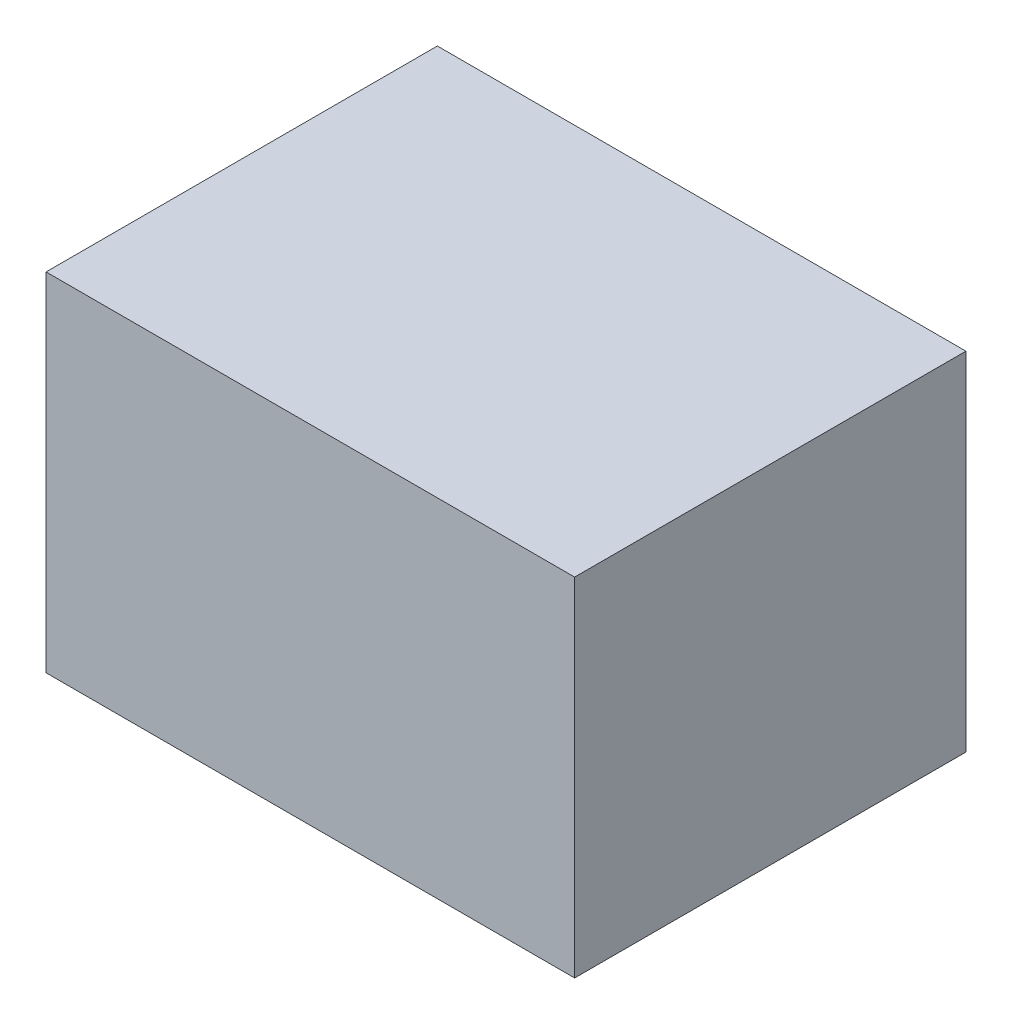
ISO-10303-21;
HEADER;
FILE_DESCRIPTION(('STEP AP214'),'2;1');
FILE_NAME('part.step','',(''),(''),'','','');
FILE_SCHEMA(('AUTOMOTIVE_DESIGN { 1 0 10303 214 1 1 1 1 }'));
ENDSEC;
DATA;
#1=APPLICATION_CONTEXT('core data for automotive mechanical design processes');
#2=APPLICATION_PROTOCOL_DEFINITION('international standard','automotive_design',2000,#1);
#3=PRODUCT_CONTEXT('',#1,'mechanical');
#4=PRODUCT('Part','Part','',(#3));
#5=PRODUCT_RELATED_PRODUCT_CATEGORY('part','',(#4));
#6=PRODUCT_DEFINITION_FORMATION('','',#4);
#7=PRODUCT_DEFINITION_CONTEXT('part definition',#1,'design');
#8=PRODUCT_DEFINITION('design','',#6,#7);
#9=PRODUCT_DEFINITION_SHAPE('','',#8);
#10=(LENGTH_UNIT() NAMED_UNIT(*) SI_UNIT(.MILLI.,.METRE.));
#11=(NAMED_UNIT(*) PLANE_ANGLE_UNIT() SI_UNIT($,.RADIAN.));
#12=(NAMED_UNIT(*) SI_UNIT($,.STERADIAN.) SOLID_ANGLE_UNIT());
#13=UNCERTAINTY_MEASURE_WITH_UNIT(LENGTH_MEASURE(1.E-05),#10,'distance_accuracy_value','');
#14=(GEOMETRIC_REPRESENTATION_CONTEXT(3) GLOBAL_UNCERTAINTY_ASSIGNED_CONTEXT((#13)) GLOBAL_UNIT_ASSIGNED_CONTEXT((#10,
#11,#12)) REPRESENTATION_CONTEXT('',''));
#15=CARTESIAN_POINT('',(0.,0.,0.));
#16=DIRECTION('',(0.,0.,1.));
#17=DIRECTION('',(1.,0.,0.));
#18=AXIS2_PLACEMENT_3D('',#15,#16,#17);
#19=CARTESIAN_POINT('',(250.08,79.5288218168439,99.701098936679));
#20=DIRECTION('',(0.,0.,-1.));
#21=DIRECTION('',(-1.,0.,0.));
#22=AXIS2_PLACEMENT_3D('',#19,#20,#21);
#23=PLANE('',#22);
#24=DIRECTION('',(0.,-1.,0.));
#25=VECTOR('',#24,1.);
#26=CARTESIAN_POINT('',(0.,79.5288218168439,99.701098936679));
#27=LINE('',#26,#25);
#28=CARTESIAN_POINT('',(0.,79.5288218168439,99.701098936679));
#29=VERTEX_POINT('',#28);
#30=CARTESIAN_POINT('',(0.,-84.743826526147,99.701098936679));
#31=VERTEX_POINT('',#30);
#32=EDGE_CURVE('E587',#29,#31,#27,.T.);
#33=ORIENTED_EDGE('',*,*,#32,.T.);
#34=DIRECTION('',(-1.,0.,0.));
#35=VECTOR('',#34,1.);
#36=CARTESIAN_POINT('',(250.08,-84.743826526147,99.701098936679));
#37=LINE('',#36,#35);
#38=CARTESIAN_POINT('',(250.08,-84.743826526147,99.701098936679));
#39=VERTEX_POINT('',#38);
#40=EDGE_CURVE('E13',#39,#31,#37,.T.);
#41=ORIENTED_EDGE('',*,*,#40,.F.);
#42=DIRECTION('',(0.,-1.,0.));
#43=VECTOR('',#42,1.);
#44=CARTESIAN_POINT('',(250.08,79.5288218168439,99.701098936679));
#45=LINE('',#44,#43);
#46=CARTESIAN_POINT('',(250.08,79.5288218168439,99.701098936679));
#47=VERTEX_POINT('',#46);
#48=EDGE_CURVE('E605',#47,#39,#45,.T.);
#49=ORIENTED_EDGE('',*,*,#48,.F.);
#50=DIRECTION('',(-1.,0.,0.));
#51=VECTOR('',#50,1.);
#52=CARTESIAN_POINT('',(250.08,79.5288218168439,99.701098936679));
#53=LINE('',#52,#51);
#54=EDGE_CURVE('E599',#47,#29,#53,.T.);
#55=ORIENTED_EDGE('',*,*,#54,.T.);
#56=EDGE_LOOP('',(#33,#41,#49,#55));
#57=FACE_BOUND('',#56,.T.);
#58=ADVANCED_FACE('F543',(#57),#23,.F.);
#59=CARTESIAN_POINT('',(250.08,-84.743826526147,99.701098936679));
#60=DIRECTION('',(0.,1.,0.));
#61=DIRECTION('',(0.,0.,1.));
#62=AXIS2_PLACEMENT_3D('',#59,#60,#61);
#63=PLANE('',#62);
#64=DIRECTION('',(0.,0.,-1.));
#65=VECTOR('',#64,1.);
#66=CARTESIAN_POINT('',(0.,-84.743826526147,99.701098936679));
#67=LINE('',#66,#65);
#68=CARTESIAN_POINT('',(0.,-84.743826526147,-85.4315682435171));
#69=VERTEX_POINT('',#68);
#70=EDGE_CURVE('E584',#31,#69,#67,.T.);
#71=ORIENTED_EDGE('',*,*,#70,.T.);
#72=DIRECTION('',(-1.,0.,0.));
#73=VECTOR('',#72,1.);
#74=CARTESIAN_POINT('',(250.08,-84.743826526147,-85.4315682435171));
#75=LINE('',#74,#73);
#76=CARTESIAN_POINT('',(250.08,-84.743826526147,-85.4315682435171));
#77=VERTEX_POINT('',#76);
#78=EDGE_CURVE('E551',#77,#69,#75,.T.);
#79=ORIENTED_EDGE('',*,*,#78,.F.);
#80=DIRECTION('',(0.,0.,-1.));
#81=VECTOR('',#80,1.);
#82=CARTESIAN_POINT('',(250.08,-84.743826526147,99.701098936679));
#83=LINE('',#82,#81);
#84=EDGE_CURVE('E595',#39,#77,#83,.T.);
#85=ORIENTED_EDGE('',*,*,#84,.F.);
#86=ORIENTED_EDGE('',*,*,#40,.T.);
#87=EDGE_LOOP('',(#71,#79,#85,#86));
#88=FACE_BOUND('',#87,.T.);
#89=ADVANCED_FACE('F594',(#88),#63,.F.);
#90=CARTESIAN_POINT('',(250.08,79.5288218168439,-85.4315682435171));
#91=DIRECTION('',(0.,0.,1.));
#92=DIRECTION('',(1.,0.,0.));
#93=AXIS2_PLACEMENT_3D('',#90,#91,#92);
#94=PLANE('',#93);
#95=DIRECTION('',(0.,1.,0.));
#96=VECTOR('',#95,1.);
#97=CARTESIAN_POINT('',(0.,79.5288218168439,-85.4315682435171));
#98=LINE('',#97,#96);
#99=CARTESIAN_POINT('',(0.,79.5288218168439,-85.4315682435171));
#100=VERTEX_POINT('',#99);
#101=EDGE_CURVE('E588',#69,#100,#98,.T.);
#102=ORIENTED_EDGE('',*,*,#101,.T.);
#103=DIRECTION('',(-1.,0.,0.));
#104=VECTOR('',#103,1.);
#105=CARTESIAN_POINT('',(250.08,79.5288218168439,-85.4315682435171));
#106=LINE('',#105,#104);
#107=CARTESIAN_POINT('',(250.08,79.5288218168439,-85.4315682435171));
#108=VERTEX_POINT('',#107);
#109=EDGE_CURVE('E611',#108,#100,#106,.T.);
#110=ORIENTED_EDGE('',*,*,#109,.F.);
#111=DIRECTION('',(0.,1.,0.));
#112=VECTOR('',#111,1.);
#113=CARTESIAN_POINT('',(250.08,79.5288218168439,-85.4315682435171));
#114=LINE('',#113,#112);
#115=EDGE_CURVE('E563',#77,#108,#114,.T.);
#116=ORIENTED_EDGE('',*,*,#115,.F.);
#117=ORIENTED_EDGE('',*,*,#78,.T.);
#118=EDGE_LOOP('',(#102,#110,#116,#117));
#119=FACE_BOUND('',#118,.T.);
#120=ADVANCED_FACE('F614',(#119),#94,.F.);
#121=CARTESIAN_POINT('',(250.08,79.5288218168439,99.701098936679));
#122=DIRECTION('',(0.,-1.,0.));
#123=DIRECTION('',(0.,0.,-1.));
#124=AXIS2_PLACEMENT_3D('',#121,#122,#123);
#125=PLANE('',#124);
#126=DIRECTION('',(0.,0.,1.));
#127=VECTOR('',#126,1.);
#128=CARTESIAN_POINT('',(0.,79.5288218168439,99.701098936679));
#129=LINE('',#128,#127);
#130=EDGE_CURVE('E603',#100,#29,#129,.T.);
#131=ORIENTED_EDGE('',*,*,#130,.T.);
#132=ORIENTED_EDGE('',*,*,#54,.F.);
#133=DIRECTION('',(0.,0.,1.));
#134=VECTOR('',#133,1.);
#135=CARTESIAN_POINT('',(250.08,79.5288218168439,99.701098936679));
#136=LINE('',#135,#134);
#137=EDGE_CURVE('E558',#108,#47,#136,.T.);
#138=ORIENTED_EDGE('',*,*,#137,.F.);
#139=ORIENTED_EDGE('',*,*,#109,.T.);
#140=EDGE_LOOP('',(#131,#132,#138,#139));
#141=FACE_BOUND('',#140,.T.);
#142=ADVANCED_FACE('F616',(#141),#125,.F.);
#143=CARTESIAN_POINT('',(250.08,-84.743826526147,99.701098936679));
#144=DIRECTION('',(1.,0.,0.));
#145=DIRECTION('',(0.,0.,-1.));
#146=AXIS2_PLACEMENT_3D('',#143,#144,#145);
#147=PLANE('',#146);
#148=ORIENTED_EDGE('',*,*,#48,.T.);
#149=ORIENTED_EDGE('',*,*,#84,.T.);
#150=ORIENTED_EDGE('',*,*,#115,.T.);
#151=ORIENTED_EDGE('',*,*,#137,.T.);
#152=EDGE_LOOP('',(#148,#149,#150,#151));
#153=FACE_BOUND('',#152,.T.);
#154=ADVANCED_FACE('F617',(#153),#147,.T.);
#155=CARTESIAN_POINT('',(0.,0.,0.));
#156=DIRECTION('',(1.,0.,0.));
#157=DIRECTION('',(0.,0.,-1.));
#158=AXIS2_PLACEMENT_3D('',#155,#156,#157);
#159=PLANE('',#158);
#160=ORIENTED_EDGE('',*,*,#32,.F.);
#161=ORIENTED_EDGE('',*,*,#130,.F.);
#162=ORIENTED_EDGE('',*,*,#101,.F.);
#163=ORIENTED_EDGE('',*,*,#70,.F.);
#164=EDGE_LOOP('',(#160,#161,#162,#163));
#165=FACE_BOUND('',#164,.T.);
#166=ADVANCED_FACE('F545',(#165),#159,.F.);
#167=CLOSED_SHELL('',(#58,#89,#120,#142,#154,#166));
#168=MANIFOLD_SOLID_BREP('B2',#167);
#169=ADVANCED_BREP_SHAPE_REPRESENTATION('',(#18,#168),#14);
#170=SHAPE_DEFINITION_REPRESENTATION(#9,#169);
ENDSEC;
END-ISO-10303-21;
